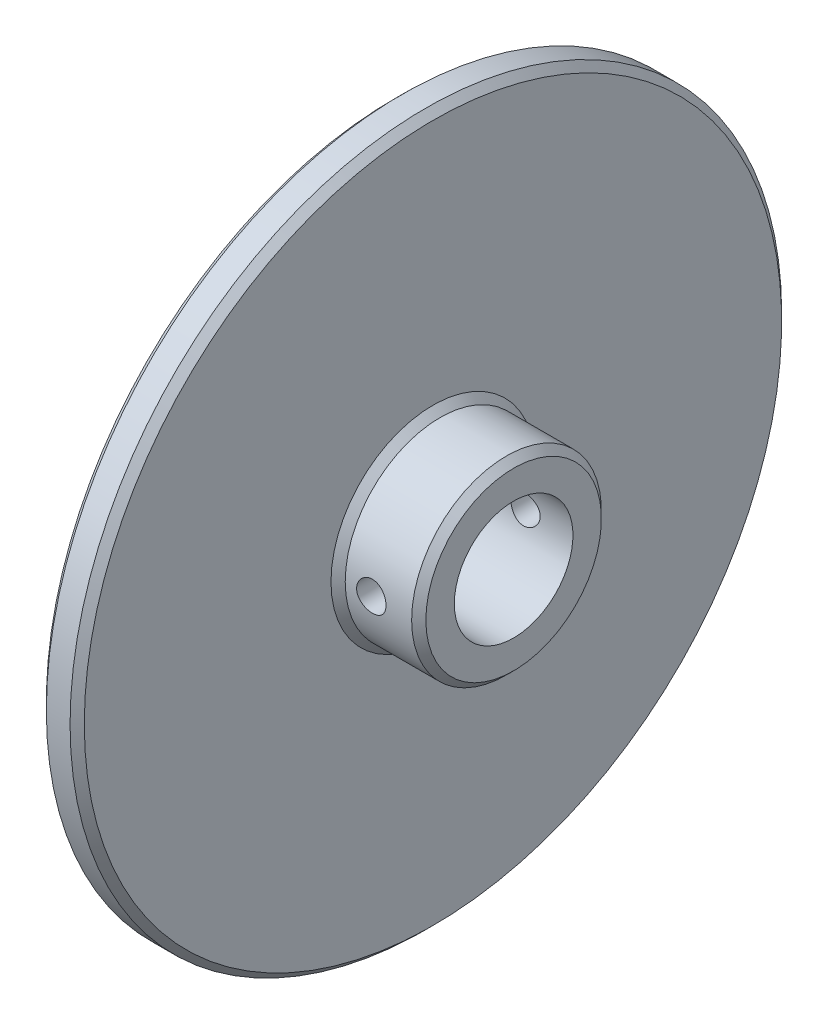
from build123d import *

# Parameters (mm, degrees)
CHANFREIN1_SIZE              = 1.5
ENL_V_MAT_EXTRU_1_DEPTH      = 109.972473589
ENL_V_MAT_EXTRU_1_DEPTH_BACK = 109.972473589
ESQUISSE2_R                  = 3.1


with BuildPart() as part:
    # Esquisse1 → R_volution1 (revolve)
    with BuildSketch(Plane.XY, mode=Mode.PRIVATE) as r_volution1_sk:
        Polygon((0, 75), (8, 75), (8, 20), (25, 20), (25, 12.5), (0, 12.5), align=None)
    revolve(r_volution1_sk.sketch.rotate(Axis((-43.705284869, 0, 0), (1, 0, 0)), 90), axis=Axis((-43.705284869, 0, 0), (1, 0, 0)))

    # Chanfrein1
    chanfrein1_edges = [part.edges().sort_by_distance(p)[0] for p in [
        (0, 0, -75),
        (8, 0, -75),
        (8, 0, -20),
        (25, 0, -20),
        (0, 0, -12.5),
    ]]
    chamfer(chanfrein1_edges, length=CHANFREIN1_SIZE)

    # Esquisse2 → Enl_v. mat.-Extru.1 (cut, two sides: drawn at the far end of the back side and taken through both)
    with BuildSketch(Plane.XY.offset(-ENL_V_MAT_EXTRU_1_DEPTH_BACK)):
        with Locations((15, 0)):
            Circle(ESQUISSE2_R)
    extrude(amount=ENL_V_MAT_EXTRU_1_DEPTH + ENL_V_MAT_EXTRU_1_DEPTH_BACK, mode=Mode.SUBTRACT)


solid = part.part
